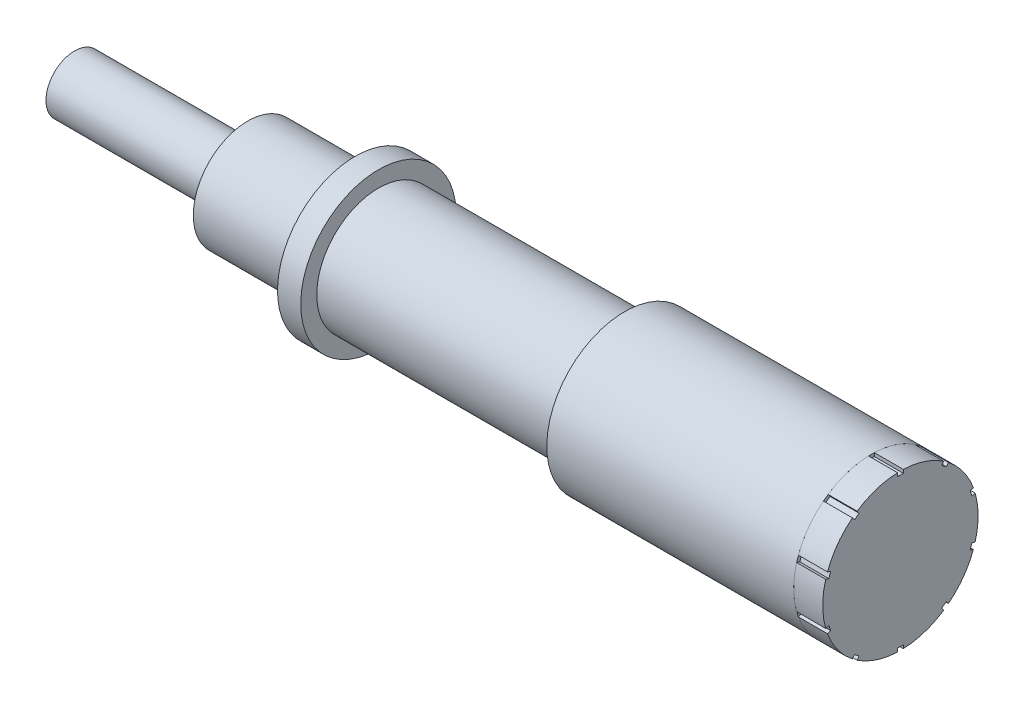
from build123d import *

# Parameters (mm, degrees)
SKETCH4_R           = 6.7945
BOSS_EXTRUDE1_DEPTH = 2.54
SKETCH5_W           = 0.508
SKETCH5_H           = 0.451946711
CUT_EXTRUDE1_DEPTH  = 2.54
CIRPATTERN1_COUNT   = 10


with BuildPart() as part:
    # Sketch1 → Revolve1 (revolve)
    with BuildSketch(Plane.XY, mode=Mode.PRIVATE) as revolve1_sk:
        Polygon((60.8838, 0), (60.8838, 6.7945), (39.296487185, 6.7945), (39.296487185, 5.3975), (17.78, 5.3975), (17.78, 6.7945), (15.748, 6.7945), (15.748, 4.7625), (6.35, 4.7625), (6.35, 2.5019), (-8.790644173, 2.5019), (-8.790644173, 0), align=None)
    revolve(revolve1_sk.sketch.rotate(Axis((-8.790644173, 0, 0), (1, 0, 0)), 180), axis=Axis((-8.790644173, 0, 0), (1, 0, 0)))


with BuildPart() as body_2:
    # Sketch4 → Boss-Extrude1 (new body)
    with BuildSketch(Plane(origin=(60.8838, 0, 0), x_dir=(0, 0, -1), z_dir=(1, 0, 0))):
        Circle(SKETCH4_R)
    extrude(amount=BOSS_EXTRUDE1_DEPTH)

    # Sketch5 → Cut-Extrude1 (cut)
    with BuildSketch(Plane(origin=(63.4238, 0, 0), x_dir=(0, 0, -1), z_dir=(1, 0, 0))):
        with Locations((0, 6.718941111)):
            Rectangle(SKETCH5_W, SKETCH5_H)
    cut_extrude1 = extrude(amount=-CUT_EXTRUDE1_DEPTH, mode=Mode.SUBTRACT)

    # CirPattern1: Cut-Extrude1 ×10 about axis
    cirpattern1_axis = Axis((0, 0, 0), (1, 0, 0))
    for i in range(1, CIRPATTERN1_COUNT):
        add(cut_extrude1.rotate(cirpattern1_axis, i * 360 / CIRPATTERN1_COUNT), mode=Mode.SUBTRACT)


solid = Compound([part.part, body_2.part])
